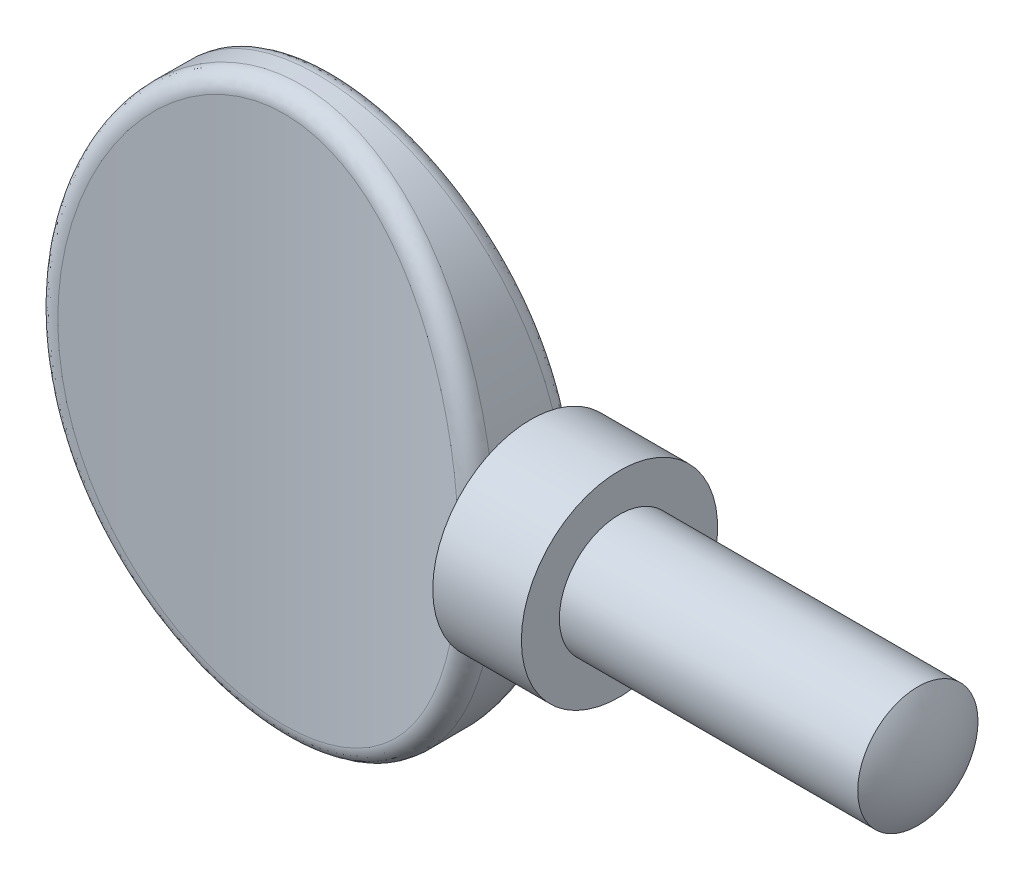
from build123d import *

# Parameters (mm, degrees)
SKETCH1_RX              = 11.303
SKETCH1_RY              = 8.889999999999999
EXTRUDE1_DEPTH          = 2.286
CUT_EXTRUDE1_DEPTH      = 15.560759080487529
CUT_EXTRUDE1_DEPTH_BACK = 15.560759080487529
SKETCH2_OUTSIDE_W       = 25.603999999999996
SKETCH2_OUTSIDE_H       = 12.396
FILLET3_R               = 0.6773333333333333


with BuildPart() as part:
    # Sketch1 → Extrude1 (new, symmetric)
    with BuildSketch(Plane.XY):
        with Locations(Location((0, 0), (0, 0, 90))):
            Ellipse(SKETCH1_RX, SKETCH1_RY)
    extrude(amount=EXTRUDE1_DEPTH, both=True)

    # Sketch2 outside → Cut-Extrude1 (cut, two sides: drawn at the far end of the back side and taken through both)
    with BuildSketch(Plane(origin=(0, 0, 0), x_dir=(1, 0, 0), z_dir=(0, 1, 0)).offset(-CUT_EXTRUDE1_DEPTH_BACK)):
        Rectangle(SKETCH2_OUTSIDE_W, SKETCH2_OUTSIDE_H)
        with BuildLine():
            Line((-8.889999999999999, 2.286), (-8.889999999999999, -2.286))
            ThreePointArc((-8.889999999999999, -2.286), (1.94e-15, -1.0159999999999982), (8.889999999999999, -2.286))
            Line((8.889999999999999, -2.286), (8.889999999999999, 2.286))
            ThreePointArc((8.889999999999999, 2.286), (1.94e-15, 1.0159999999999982), (-8.889999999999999, 2.286))
        make_face(mode=Mode.SUBTRACT)
    extrude(amount=CUT_EXTRUDE1_DEPTH + CUT_EXTRUDE1_DEPTH_BACK, mode=Mode.SUBTRACT)

    # Fillet3
    fillet3_edges = [part.edges().sort_by_distance(p)[0] for p in [
        (-6.499256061e-08, -11.302999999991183, 1.0159999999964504),
        (8.835220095e-08, -11.302999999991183, -1.0159999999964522),
    ]]
    fillet(fillet3_edges, radius=FILLET3_R)

    # Sketch3 → Revolve1 (revolve)
    with BuildSketch(Plane(origin=(0, 0, 0), x_dir=(1, 0, 0), z_dir=(0, 1, 0)), mode=Mode.PRIVATE) as revolve1_sk:
        with BuildLine():
            Line((12.445999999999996, 3.9369999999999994), (12.445999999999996, 2.413))
            Line((12.445999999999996, 2.413), (24.41915612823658, 2.4129999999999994))
            ThreePointArc((24.41915612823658, 2.4129999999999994), (24.960344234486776, 1.2600467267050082), (25.145999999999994, 0))
            Line((25.145999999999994, 0), (7.236423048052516, 0))
            Line((7.236423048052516, 0), (7.236423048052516, 1.8516557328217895))
            ThreePointArc((7.236423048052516, 1.8516557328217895), (8.426438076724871, 2.6063068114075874), (8.889999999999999, 3.9370000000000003))
            Line((8.889999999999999, 3.9370000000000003), (12.445999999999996, 3.9369999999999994))
        make_face()
    revolve(revolve1_sk.sketch.rotate(Axis((0, 0, 0), (1, 0, 0)), 180), axis=Axis((0, 0, 0), (1, 0, 0)))


solid = part.part
